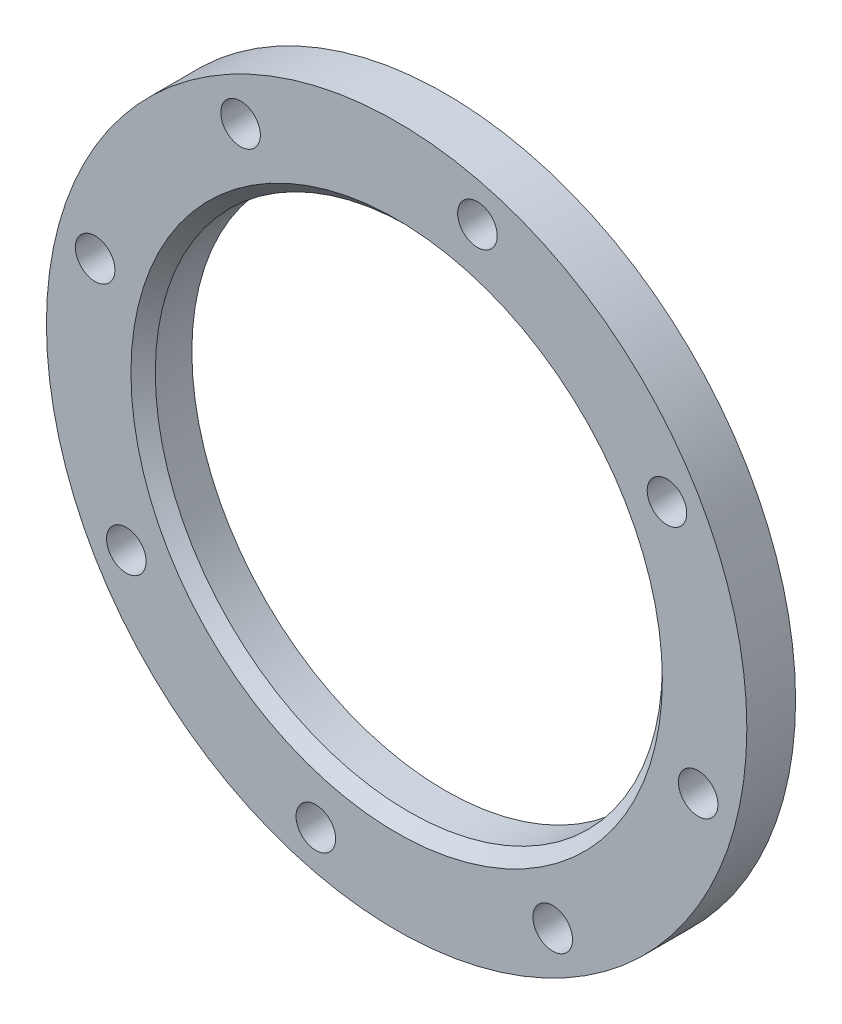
ISO-10303-21;
HEADER;
FILE_DESCRIPTION(('STEP AP214'),'2;1');
FILE_NAME('part.step','',(''),(''),'','','');
FILE_SCHEMA(('AUTOMOTIVE_DESIGN { 1 0 10303 214 1 1 1 1 }'));
ENDSEC;
DATA;
#1=APPLICATION_CONTEXT('core data for automotive mechanical design processes');
#2=APPLICATION_PROTOCOL_DEFINITION('international standard','automotive_design',2000,#1);
#3=PRODUCT_CONTEXT('',#1,'mechanical');
#4=PRODUCT('Part','Part','',(#3));
#5=PRODUCT_RELATED_PRODUCT_CATEGORY('part','',(#4));
#6=PRODUCT_DEFINITION_FORMATION('','',#4);
#7=PRODUCT_DEFINITION_CONTEXT('part definition',#1,'design');
#8=PRODUCT_DEFINITION('design','',#6,#7);
#9=PRODUCT_DEFINITION_SHAPE('','',#8);
#10=(LENGTH_UNIT() NAMED_UNIT(*) SI_UNIT(.MILLI.,.METRE.));
#11=(NAMED_UNIT(*) PLANE_ANGLE_UNIT() SI_UNIT($,.RADIAN.));
#12=(NAMED_UNIT(*) SI_UNIT($,.STERADIAN.) SOLID_ANGLE_UNIT());
#13=UNCERTAINTY_MEASURE_WITH_UNIT(LENGTH_MEASURE(1.E-05),#10,'distance_accuracy_value','');
#14=(GEOMETRIC_REPRESENTATION_CONTEXT(3) GLOBAL_UNCERTAINTY_ASSIGNED_CONTEXT((#13)) GLOBAL_UNIT_ASSIGNED_CONTEXT((#10,
#11,#12)) REPRESENTATION_CONTEXT('',''));
#15=CARTESIAN_POINT('',(0.,0.,0.));
#16=DIRECTION('',(0.,0.,1.));
#17=DIRECTION('',(1.,0.,0.));
#18=AXIS2_PLACEMENT_3D('',#15,#16,#17);
#19=CARTESIAN_POINT('',(0.,0.,32.));
#20=DIRECTION('',(0.,0.,1.));
#21=DIRECTION('',(1.,0.,0.));
#22=AXIS2_PLACEMENT_3D('',#19,#20,#21);
#23=PLANE('',#22);
#24=CARTESIAN_POINT('',(-102.499999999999,177.53520777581,32.));
#25=DIRECTION('',(0.,0.,1.));
#26=DIRECTION('',(0.707106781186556,0.707106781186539,0.));
#27=AXIS2_PLACEMENT_3D('',#24,#25,#26);
#28=CIRCLE('',#27,13.);
#29=CARTESIAN_POINT('',(-93.3076118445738,186.727595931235,32.));
#30=VERTEX_POINT('',#29);
#31=EDGE_CURVE('E100',#30,#30,#28,.T.);
#32=ORIENTED_EDGE('',*,*,#31,.F.);
#33=EDGE_LOOP('',(#32));
#34=FACE_BOUND('',#33,.T.);
#35=CARTESIAN_POINT('',(-198.014794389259,53.0579042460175,32.));
#36=DIRECTION('',(0.,0.,1.));
#37=DIRECTION('',(0.,1.,0.));
#38=AXIS2_PLACEMENT_3D('',#35,#36,#37);
#39=CIRCLE('',#38,13.);
#40=CARTESIAN_POINT('',(-198.014794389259,66.0579042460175,32.));
#41=VERTEX_POINT('',#40);
#42=EDGE_CURVE('E94',#41,#41,#39,.T.);
#43=ORIENTED_EDGE('',*,*,#42,.F.);
#44=EDGE_LOOP('',(#43));
#45=FACE_BOUND('',#44,.T.);
#46=CARTESIAN_POINT('',(-177.53520777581,-102.5,32.));
#47=DIRECTION('',(0.,0.,1.));
#48=DIRECTION('',(-0.707106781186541,0.707106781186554,0.));
#49=AXIS2_PLACEMENT_3D('',#46,#47,#48);
#50=CIRCLE('',#49,13.);
#51=CARTESIAN_POINT('',(-186.727595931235,-93.3076118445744,32.));
#52=VERTEX_POINT('',#51);
#53=EDGE_CURVE('E88',#52,#52,#50,.T.);
#54=ORIENTED_EDGE('',*,*,#53,.F.);
#55=EDGE_LOOP('',(#54));
#56=FACE_BOUND('',#55,.T.);
#57=CARTESIAN_POINT('',(-53.0579042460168,-198.014794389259,32.));
#58=DIRECTION('',(0.,0.,1.));
#59=DIRECTION('',(-1.,0.,0.));
#60=AXIS2_PLACEMENT_3D('',#57,#58,#59);
#61=CIRCLE('',#60,13.);
#62=CARTESIAN_POINT('',(-66.0579042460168,-198.014794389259,32.));
#63=VERTEX_POINT('',#62);
#64=EDGE_CURVE('E82',#63,#63,#61,.T.);
#65=ORIENTED_EDGE('',*,*,#64,.F.);
#66=EDGE_LOOP('',(#65));
#67=FACE_BOUND('',#66,.T.);
#68=CARTESIAN_POINT('',(102.5,-177.53520777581,32.));
#69=DIRECTION('',(0.,0.,1.));
#70=DIRECTION('',(-0.707106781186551,-0.707106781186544,0.));
#71=AXIS2_PLACEMENT_3D('',#68,#69,#70);
#72=CIRCLE('',#71,13.);
#73=CARTESIAN_POINT('',(93.3076118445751,-186.727595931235,32.));
#74=VERTEX_POINT('',#73);
#75=EDGE_CURVE('E76',#74,#74,#72,.T.);
#76=ORIENTED_EDGE('',*,*,#75,.F.);
#77=EDGE_LOOP('',(#76));
#78=FACE_BOUND('',#77,.T.);
#79=CARTESIAN_POINT('',(198.014794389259,-53.0579042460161,32.));
#80=DIRECTION('',(0.,0.,1.));
#81=DIRECTION('',(0.,-1.,0.));
#82=AXIS2_PLACEMENT_3D('',#79,#80,#81);
#83=CIRCLE('',#82,13.);
#84=CARTESIAN_POINT('',(198.014794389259,-66.0579042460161,32.));
#85=VERTEX_POINT('',#84);
#86=EDGE_CURVE('E70',#85,#85,#83,.T.);
#87=ORIENTED_EDGE('',*,*,#86,.F.);
#88=EDGE_LOOP('',(#87));
#89=FACE_BOUND('',#88,.T.);
#90=CARTESIAN_POINT('',(177.535207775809,102.500000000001,32.));
#91=DIRECTION('',(0.,0.,1.));
#92=DIRECTION('',(0.707106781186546,-0.707106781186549,0.));
#93=AXIS2_PLACEMENT_3D('',#90,#91,#92);
#94=CIRCLE('',#93,13.);
#95=CARTESIAN_POINT('',(186.727595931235,93.3076118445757,32.));
#96=VERTEX_POINT('',#95);
#97=EDGE_CURVE('E64',#96,#96,#94,.T.);
#98=ORIENTED_EDGE('',*,*,#97,.F.);
#99=EDGE_LOOP('',(#98));
#100=FACE_BOUND('',#99,.T.);
#101=CARTESIAN_POINT('',(53.0579042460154,198.014794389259,32.));
#102=DIRECTION('',(0.,0.,1.));
#103=DIRECTION('',(1.,0.,0.));
#104=AXIS2_PLACEMENT_3D('',#101,#102,#103);
#105=CIRCLE('',#104,13.);
#106=CARTESIAN_POINT('',(66.0579042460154,198.014794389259,32.));
#107=VERTEX_POINT('',#106);
#108=EDGE_CURVE('E58',#107,#107,#105,.T.);
#109=ORIENTED_EDGE('',*,*,#108,.F.);
#110=EDGE_LOOP('',(#109));
#111=FACE_BOUND('',#110,.T.);
#112=CARTESIAN_POINT('',(0.,0.,32.));
#113=DIRECTION('',(0.,0.,1.));
#114=DIRECTION('',(1.,0.,0.));
#115=AXIS2_PLACEMENT_3D('',#112,#113,#114);
#116=CIRCLE('',#115,174.5);
#117=CARTESIAN_POINT('',(174.5,0.,32.));
#118=VERTEX_POINT('',#117);
#119=EDGE_CURVE('E10',#118,#118,#116,.F.);
#120=ORIENTED_EDGE('',*,*,#119,.T.);
#121=EDGE_LOOP('',(#120));
#122=FACE_BOUND('',#121,.T.);
#123=CARTESIAN_POINT('',(0.,0.,32.));
#124=DIRECTION('',(0.,0.,1.));
#125=DIRECTION('',(1.,0.,0.));
#126=AXIS2_PLACEMENT_3D('',#123,#124,#125);
#127=CIRCLE('',#126,230.);
#128=CARTESIAN_POINT('',(230.,0.,32.));
#129=VERTEX_POINT('',#128);
#130=EDGE_CURVE('E45',#129,#129,#127,.T.);
#131=ORIENTED_EDGE('',*,*,#130,.T.);
#132=EDGE_LOOP('',(#131));
#133=FACE_BOUND('',#132,.T.);
#134=ADVANCED_FACE('F34',(#34,#45,#56,#67,#78,#89,#100,#111,#122,#133),#23,.T.);
#135=CARTESIAN_POINT('',(0.,0.,0.));
#136=DIRECTION('',(0.,0.,1.));
#137=DIRECTION('',(1.,0.,0.));
#138=AXIS2_PLACEMENT_3D('',#135,#136,#137);
#139=PLANE('',#138);
#140=CARTESIAN_POINT('',(-102.499999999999,177.53520777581,0.));
#141=DIRECTION('',(0.,0.,1.));
#142=DIRECTION('',(0.707106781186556,0.707106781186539,0.));
#143=AXIS2_PLACEMENT_3D('',#140,#141,#142);
#144=CIRCLE('',#143,13.);
#145=CARTESIAN_POINT('',(-93.3076118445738,186.727595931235,0.));
#146=VERTEX_POINT('',#145);
#147=EDGE_CURVE('E97',#146,#146,#144,.T.);
#148=ORIENTED_EDGE('',*,*,#147,.T.);
#149=EDGE_LOOP('',(#148));
#150=FACE_BOUND('',#149,.T.);
#151=CARTESIAN_POINT('',(-198.014794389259,53.0579042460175,0.));
#152=DIRECTION('',(0.,0.,1.));
#153=DIRECTION('',(0.,1.,0.));
#154=AXIS2_PLACEMENT_3D('',#151,#152,#153);
#155=CIRCLE('',#154,13.);
#156=CARTESIAN_POINT('',(-198.014794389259,66.0579042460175,0.));
#157=VERTEX_POINT('',#156);
#158=EDGE_CURVE('E91',#157,#157,#155,.T.);
#159=ORIENTED_EDGE('',*,*,#158,.T.);
#160=EDGE_LOOP('',(#159));
#161=FACE_BOUND('',#160,.T.);
#162=CARTESIAN_POINT('',(-177.53520777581,-102.5,0.));
#163=DIRECTION('',(0.,0.,1.));
#164=DIRECTION('',(-0.707106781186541,0.707106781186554,0.));
#165=AXIS2_PLACEMENT_3D('',#162,#163,#164);
#166=CIRCLE('',#165,13.);
#167=CARTESIAN_POINT('',(-186.727595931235,-93.3076118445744,0.));
#168=VERTEX_POINT('',#167);
#169=EDGE_CURVE('E85',#168,#168,#166,.T.);
#170=ORIENTED_EDGE('',*,*,#169,.T.);
#171=EDGE_LOOP('',(#170));
#172=FACE_BOUND('',#171,.T.);
#173=CARTESIAN_POINT('',(-53.0579042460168,-198.014794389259,0.));
#174=DIRECTION('',(0.,0.,1.));
#175=DIRECTION('',(-1.,0.,0.));
#176=AXIS2_PLACEMENT_3D('',#173,#174,#175);
#177=CIRCLE('',#176,13.);
#178=CARTESIAN_POINT('',(-66.0579042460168,-198.014794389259,0.));
#179=VERTEX_POINT('',#178);
#180=EDGE_CURVE('E79',#179,#179,#177,.T.);
#181=ORIENTED_EDGE('',*,*,#180,.T.);
#182=EDGE_LOOP('',(#181));
#183=FACE_BOUND('',#182,.T.);
#184=CARTESIAN_POINT('',(102.5,-177.53520777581,0.));
#185=DIRECTION('',(0.,0.,1.));
#186=DIRECTION('',(-0.707106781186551,-0.707106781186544,0.));
#187=AXIS2_PLACEMENT_3D('',#184,#185,#186);
#188=CIRCLE('',#187,13.);
#189=CARTESIAN_POINT('',(93.3076118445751,-186.727595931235,0.));
#190=VERTEX_POINT('',#189);
#191=EDGE_CURVE('E73',#190,#190,#188,.T.);
#192=ORIENTED_EDGE('',*,*,#191,.T.);
#193=EDGE_LOOP('',(#192));
#194=FACE_BOUND('',#193,.T.);
#195=CARTESIAN_POINT('',(198.014794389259,-53.0579042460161,0.));
#196=DIRECTION('',(0.,0.,1.));
#197=DIRECTION('',(0.,-1.,0.));
#198=AXIS2_PLACEMENT_3D('',#195,#196,#197);
#199=CIRCLE('',#198,13.);
#200=CARTESIAN_POINT('',(198.014794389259,-66.0579042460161,0.));
#201=VERTEX_POINT('',#200);
#202=EDGE_CURVE('E67',#201,#201,#199,.T.);
#203=ORIENTED_EDGE('',*,*,#202,.T.);
#204=EDGE_LOOP('',(#203));
#205=FACE_BOUND('',#204,.T.);
#206=CARTESIAN_POINT('',(177.535207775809,102.500000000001,0.));
#207=DIRECTION('',(0.,0.,1.));
#208=DIRECTION('',(0.707106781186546,-0.707106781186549,0.));
#209=AXIS2_PLACEMENT_3D('',#206,#207,#208);
#210=CIRCLE('',#209,13.);
#211=CARTESIAN_POINT('',(186.727595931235,93.3076118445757,0.));
#212=VERTEX_POINT('',#211);
#213=EDGE_CURVE('E61',#212,#212,#210,.T.);
#214=ORIENTED_EDGE('',*,*,#213,.T.);
#215=EDGE_LOOP('',(#214));
#216=FACE_BOUND('',#215,.T.);
#217=CARTESIAN_POINT('',(53.0579042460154,198.014794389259,0.));
#218=DIRECTION('',(0.,0.,1.));
#219=DIRECTION('',(1.,0.,0.));
#220=AXIS2_PLACEMENT_3D('',#217,#218,#219);
#221=CIRCLE('',#220,13.);
#222=CARTESIAN_POINT('',(66.0579042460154,198.014794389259,0.));
#223=VERTEX_POINT('',#222);
#224=EDGE_CURVE('E57',#223,#223,#221,.T.);
#225=ORIENTED_EDGE('',*,*,#224,.T.);
#226=EDGE_LOOP('',(#225));
#227=FACE_BOUND('',#226,.T.);
#228=CARTESIAN_POINT('',(0.,0.,0.));
#229=DIRECTION('',(0.,0.,1.));
#230=DIRECTION('',(1.,0.,0.));
#231=AXIS2_PLACEMENT_3D('',#228,#229,#230);
#232=CIRCLE('',#231,230.);
#233=CARTESIAN_POINT('',(230.,0.,0.));
#234=VERTEX_POINT('',#233);
#235=EDGE_CURVE('E49',#234,#234,#232,.T.);
#236=ORIENTED_EDGE('',*,*,#235,.F.);
#237=EDGE_LOOP('',(#236));
#238=FACE_BOUND('',#237,.T.);
#239=CARTESIAN_POINT('',(0.,0.,0.));
#240=DIRECTION('',(0.,0.,1.));
#241=DIRECTION('',(1.,0.,0.));
#242=AXIS2_PLACEMENT_3D('',#239,#240,#241);
#243=CIRCLE('',#242,166.5);
#244=CARTESIAN_POINT('',(166.5,0.,0.));
#245=VERTEX_POINT('',#244);
#246=EDGE_CURVE('E53',#245,#245,#243,.T.);
#247=ORIENTED_EDGE('',*,*,#246,.T.);
#248=EDGE_LOOP('',(#247));
#249=FACE_BOUND('',#248,.T.);
#250=ADVANCED_FACE('F106',(#150,#161,#172,#183,#194,#205,#216,#227,#238,#249),#139,.F.);
#251=CARTESIAN_POINT('',(0.,0.,32.));
#252=DIRECTION('',(0.,0.,-1.));
#253=DIRECTION('',(-1.,0.,0.));
#254=AXIS2_PLACEMENT_3D('',#251,#252,#253);
#255=CYLINDRICAL_SURFACE('',#254,230.);
#256=ORIENTED_EDGE('',*,*,#130,.F.);
#257=EDGE_LOOP('',(#256));
#258=FACE_BOUND('',#257,.T.);
#259=ORIENTED_EDGE('',*,*,#235,.T.);
#260=EDGE_LOOP('',(#259));
#261=FACE_BOUND('',#260,.T.);
#262=ADVANCED_FACE('F135',(#258,#261),#255,.T.);
#263=CARTESIAN_POINT('',(0.,0.,32.));
#264=DIRECTION('',(0.,0.,-1.));
#265=DIRECTION('',(-1.,0.,0.));
#266=AXIS2_PLACEMENT_3D('',#263,#264,#265);
#267=CYLINDRICAL_SURFACE('',#266,166.5);
#268=CARTESIAN_POINT('',(0.,0.,24.));
#269=DIRECTION('',(0.,0.,1.));
#270=DIRECTION('',(1.,0.,0.));
#271=AXIS2_PLACEMENT_3D('',#268,#269,#270);
#272=CIRCLE('',#271,166.5);
#273=CARTESIAN_POINT('',(166.5,0.,24.));
#274=VERTEX_POINT('',#273);
#275=EDGE_CURVE('E41',#274,#274,#272,.T.);
#276=ORIENTED_EDGE('',*,*,#275,.T.);
#277=EDGE_LOOP('',(#276));
#278=FACE_BOUND('',#277,.T.);
#279=ORIENTED_EDGE('',*,*,#246,.F.);
#280=EDGE_LOOP('',(#279));
#281=FACE_BOUND('',#280,.T.);
#282=ADVANCED_FACE('F138',(#278,#281),#267,.F.);
#283=CARTESIAN_POINT('',(0.,0.,24.));
#284=DIRECTION('',(0.,0.,1.));
#285=DIRECTION('',(1.,0.,0.));
#286=AXIS2_PLACEMENT_3D('',#283,#284,#285);
#287=CONICAL_SURFACE('',#286,166.5,0.785398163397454);
#288=ORIENTED_EDGE('',*,*,#119,.F.);
#289=EDGE_LOOP('',(#288));
#290=FACE_BOUND('',#289,.T.);
#291=ORIENTED_EDGE('',*,*,#275,.F.);
#292=EDGE_LOOP('',(#291));
#293=FACE_BOUND('',#292,.T.);
#294=ADVANCED_FACE('F36',(#290,#293),#287,.F.);
#295=CARTESIAN_POINT('',(53.0579042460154,198.014794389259,0.));
#296=DIRECTION('',(0.,0.,1.));
#297=DIRECTION('',(1.,0.,0.));
#298=AXIS2_PLACEMENT_3D('',#295,#296,#297);
#299=CYLINDRICAL_SURFACE('',#298,13.);
#300=ORIENTED_EDGE('',*,*,#224,.F.);
#301=EDGE_LOOP('',(#300));
#302=FACE_BOUND('',#301,.T.);
#303=ORIENTED_EDGE('',*,*,#108,.T.);
#304=EDGE_LOOP('',(#303));
#305=FACE_BOUND('',#304,.T.);
#306=ADVANCED_FACE('F151',(#302,#305),#299,.F.);
#307=CARTESIAN_POINT('',(177.535207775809,102.500000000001,0.));
#308=DIRECTION('',(0.,0.,1.));
#309=DIRECTION('',(1.,0.,0.));
#310=AXIS2_PLACEMENT_3D('',#307,#308,#309);
#311=CYLINDRICAL_SURFACE('',#310,13.);
#312=ORIENTED_EDGE('',*,*,#213,.F.);
#313=EDGE_LOOP('',(#312));
#314=FACE_BOUND('',#313,.T.);
#315=ORIENTED_EDGE('',*,*,#97,.T.);
#316=EDGE_LOOP('',(#315));
#317=FACE_BOUND('',#316,.T.);
#318=ADVANCED_FACE('F156',(#314,#317),#311,.F.);
#319=CARTESIAN_POINT('',(198.014794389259,-53.0579042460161,0.));
#320=DIRECTION('',(0.,0.,1.));
#321=DIRECTION('',(1.,0.,0.));
#322=AXIS2_PLACEMENT_3D('',#319,#320,#321);
#323=CYLINDRICAL_SURFACE('',#322,13.);
#324=ORIENTED_EDGE('',*,*,#202,.F.);
#325=EDGE_LOOP('',(#324));
#326=FACE_BOUND('',#325,.T.);
#327=ORIENTED_EDGE('',*,*,#86,.T.);
#328=EDGE_LOOP('',(#327));
#329=FACE_BOUND('',#328,.T.);
#330=ADVANCED_FACE('F160',(#326,#329),#323,.F.);
#331=CARTESIAN_POINT('',(102.5,-177.53520777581,0.));
#332=DIRECTION('',(0.,0.,1.));
#333=DIRECTION('',(1.,0.,0.));
#334=AXIS2_PLACEMENT_3D('',#331,#332,#333);
#335=CYLINDRICAL_SURFACE('',#334,13.);
#336=ORIENTED_EDGE('',*,*,#191,.F.);
#337=EDGE_LOOP('',(#336));
#338=FACE_BOUND('',#337,.T.);
#339=ORIENTED_EDGE('',*,*,#75,.T.);
#340=EDGE_LOOP('',(#339));
#341=FACE_BOUND('',#340,.T.);
#342=ADVANCED_FACE('F164',(#338,#341),#335,.F.);
#343=CARTESIAN_POINT('',(-53.0579042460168,-198.014794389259,0.));
#344=DIRECTION('',(0.,0.,1.));
#345=DIRECTION('',(1.,0.,0.));
#346=AXIS2_PLACEMENT_3D('',#343,#344,#345);
#347=CYLINDRICAL_SURFACE('',#346,13.);
#348=ORIENTED_EDGE('',*,*,#180,.F.);
#349=EDGE_LOOP('',(#348));
#350=FACE_BOUND('',#349,.T.);
#351=ORIENTED_EDGE('',*,*,#64,.T.);
#352=EDGE_LOOP('',(#351));
#353=FACE_BOUND('',#352,.T.);
#354=ADVANCED_FACE('F168',(#350,#353),#347,.F.);
#355=CARTESIAN_POINT('',(-177.53520777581,-102.5,0.));
#356=DIRECTION('',(0.,0.,1.));
#357=DIRECTION('',(1.,0.,0.));
#358=AXIS2_PLACEMENT_3D('',#355,#356,#357);
#359=CYLINDRICAL_SURFACE('',#358,13.);
#360=ORIENTED_EDGE('',*,*,#169,.F.);
#361=EDGE_LOOP('',(#360));
#362=FACE_BOUND('',#361,.T.);
#363=ORIENTED_EDGE('',*,*,#53,.T.);
#364=EDGE_LOOP('',(#363));
#365=FACE_BOUND('',#364,.T.);
#366=ADVANCED_FACE('F172',(#362,#365),#359,.F.);
#367=CARTESIAN_POINT('',(-198.014794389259,53.0579042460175,0.));
#368=DIRECTION('',(0.,0.,1.));
#369=DIRECTION('',(1.,0.,0.));
#370=AXIS2_PLACEMENT_3D('',#367,#368,#369);
#371=CYLINDRICAL_SURFACE('',#370,13.);
#372=ORIENTED_EDGE('',*,*,#158,.F.);
#373=EDGE_LOOP('',(#372));
#374=FACE_BOUND('',#373,.T.);
#375=ORIENTED_EDGE('',*,*,#42,.T.);
#376=EDGE_LOOP('',(#375));
#377=FACE_BOUND('',#376,.T.);
#378=ADVANCED_FACE('F112',(#374,#377),#371,.F.);
#379=CARTESIAN_POINT('',(-102.499999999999,177.53520777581,0.));
#380=DIRECTION('',(0.,0.,1.));
#381=DIRECTION('',(1.,0.,0.));
#382=AXIS2_PLACEMENT_3D('',#379,#380,#381);
#383=CYLINDRICAL_SURFACE('',#382,13.);
#384=ORIENTED_EDGE('',*,*,#147,.F.);
#385=EDGE_LOOP('',(#384));
#386=FACE_BOUND('',#385,.T.);
#387=ORIENTED_EDGE('',*,*,#31,.T.);
#388=EDGE_LOOP('',(#387));
#389=FACE_BOUND('',#388,.T.);
#390=ADVANCED_FACE('F109',(#386,#389),#383,.F.);
#391=CLOSED_SHELL('',(#134,#250,#262,#282,#294,#306,#318,#330,#342,#354,#366,#378,#390));
#392=MANIFOLD_SOLID_BREP('B2',#391);
#393=ADVANCED_BREP_SHAPE_REPRESENTATION('',(#18,#392),#14);
#394=SHAPE_DEFINITION_REPRESENTATION(#9,#393);
ENDSEC;
END-ISO-10303-21;
